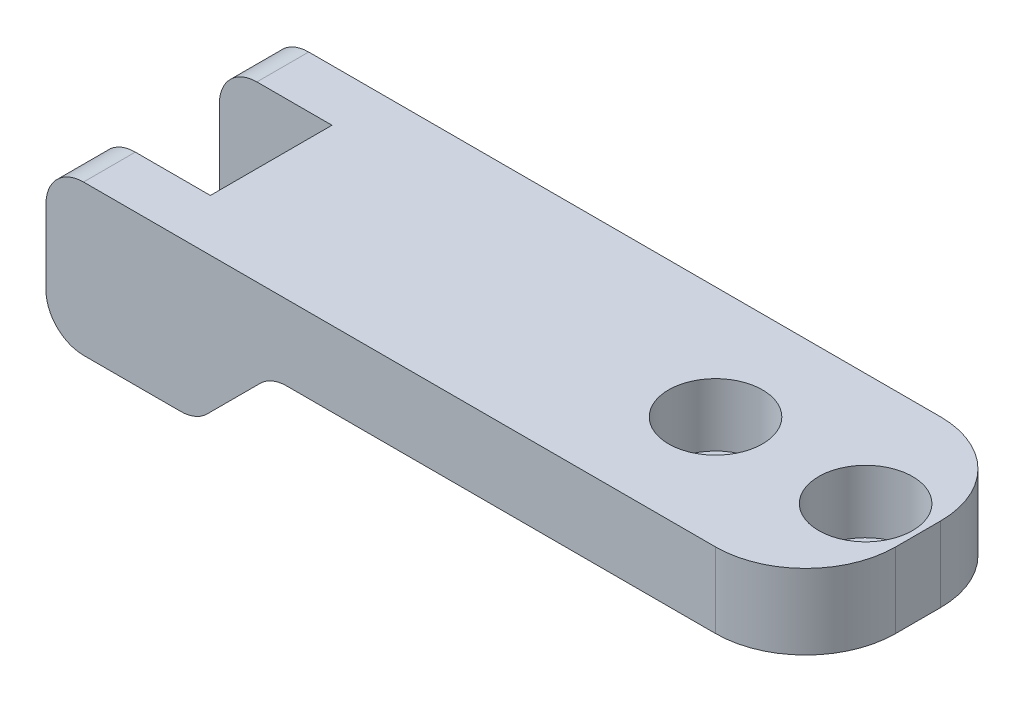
ISO-10303-21;
HEADER;
FILE_DESCRIPTION(('STEP AP214'),'2;1');
FILE_NAME('part.step','',(''),(''),'','','');
FILE_SCHEMA(('AUTOMOTIVE_DESIGN { 1 0 10303 214 1 1 1 1 }'));
ENDSEC;
DATA;
#1=APPLICATION_CONTEXT('core data for automotive mechanical design processes');
#2=APPLICATION_PROTOCOL_DEFINITION('international standard','automotive_design',2000,#1);
#3=PRODUCT_CONTEXT('',#1,'mechanical');
#4=PRODUCT('Part','Part','',(#3));
#5=PRODUCT_RELATED_PRODUCT_CATEGORY('part','',(#4));
#6=PRODUCT_DEFINITION_FORMATION('','',#4);
#7=PRODUCT_DEFINITION_CONTEXT('part definition',#1,'design');
#8=PRODUCT_DEFINITION('design','',#6,#7);
#9=PRODUCT_DEFINITION_SHAPE('','',#8);
#10=(LENGTH_UNIT() NAMED_UNIT(*) SI_UNIT(.MILLI.,.METRE.));
#11=(NAMED_UNIT(*) PLANE_ANGLE_UNIT() SI_UNIT($,.RADIAN.));
#12=(NAMED_UNIT(*) SI_UNIT($,.STERADIAN.) SOLID_ANGLE_UNIT());
#13=UNCERTAINTY_MEASURE_WITH_UNIT(LENGTH_MEASURE(1.E-05),#10,'distance_accuracy_value','');
#14=(GEOMETRIC_REPRESENTATION_CONTEXT(3) GLOBAL_UNCERTAINTY_ASSIGNED_CONTEXT((#13)) GLOBAL_UNIT_ASSIGNED_CONTEXT((#10,
#11,#12)) REPRESENTATION_CONTEXT('',''));
#15=CARTESIAN_POINT('',(0.,0.,0.));
#16=DIRECTION('',(0.,0.,1.));
#17=DIRECTION('',(1.,0.,0.));
#18=AXIS2_PLACEMENT_3D('',#15,#16,#17);
#19=CARTESIAN_POINT('',(-19.05,6.35,9.525));
#20=DIRECTION('',(0.,-1.,0.));
#21=DIRECTION('',(0.,0.,-1.));
#22=AXIS2_PLACEMENT_3D('',#19,#20,#21);
#23=PLANE('',#22);
#24=CARTESIAN_POINT('',(40.767,6.35,0.));
#25=DIRECTION('',(0.,1.,0.));
#26=DIRECTION('',(0.,0.,1.));
#27=AXIS2_PLACEMENT_3D('',#24,#25,#26);
#28=CIRCLE('',#27,3.96875);
#29=CARTESIAN_POINT('',(40.767,6.35,3.96875));
#30=VERTEX_POINT('',#29);
#31=EDGE_CURVE('E715',#30,#30,#28,.T.);
#32=ORIENTED_EDGE('',*,*,#31,.F.);
#33=EDGE_LOOP('',(#32));
#34=FACE_BOUND('',#33,.T.);
#35=DIRECTION('',(-1.,0.,0.));
#36=VECTOR('',#35,1.);
#37=CARTESIAN_POINT('',(-19.05,6.35,-9.525));
#38=LINE('',#37,#36);
#39=CARTESIAN_POINT('',(37.592,6.35,-9.525));
#40=VERTEX_POINT('',#39);
#41=CARTESIAN_POINT('',(-15.875,6.35,-9.525));
#42=VERTEX_POINT('',#41);
#43=EDGE_CURVE('E288',#40,#42,#38,.T.);
#44=ORIENTED_EDGE('',*,*,#43,.T.);
#45=DIRECTION('',(0.,0.,-1.));
#46=VECTOR('',#45,1.);
#47=CARTESIAN_POINT('',(-15.875,6.35,9.525));
#48=LINE('',#47,#46);
#49=CARTESIAN_POINT('',(-15.875,6.35,-5.1435));
#50=VERTEX_POINT('',#49);
#51=EDGE_CURVE('E406',#42,#50,#48,.F.);
#52=ORIENTED_EDGE('',*,*,#51,.T.);
#53=DIRECTION('',(-1.,0.,0.));
#54=VECTOR('',#53,1.);
#55=CARTESIAN_POINT('',(-9.52499999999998,6.35,-5.1435));
#56=LINE('',#55,#54);
#57=CARTESIAN_POINT('',(-9.52499999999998,6.35,-5.1435));
#58=VERTEX_POINT('',#57);
#59=EDGE_CURVE('E241',#58,#50,#56,.T.);
#60=ORIENTED_EDGE('',*,*,#59,.F.);
#61=DIRECTION('',(0.,0.,-1.));
#62=VECTOR('',#61,1.);
#63=CARTESIAN_POINT('',(-9.52499999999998,6.35,5.1435));
#64=LINE('',#63,#62);
#65=CARTESIAN_POINT('',(-9.52499999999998,6.35,5.1435));
#66=VERTEX_POINT('',#65);
#67=EDGE_CURVE('E213',#66,#58,#64,.T.);
#68=ORIENTED_EDGE('',*,*,#67,.F.);
#69=DIRECTION('',(1.,0.,0.));
#70=VECTOR('',#69,1.);
#71=CARTESIAN_POINT('',(-9.52499999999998,6.35,5.1435));
#72=LINE('',#71,#70);
#73=CARTESIAN_POINT('',(-15.875,6.35,5.1435));
#74=VERTEX_POINT('',#73);
#75=EDGE_CURVE('E245',#74,#66,#72,.T.);
#76=ORIENTED_EDGE('',*,*,#75,.F.);
#77=DIRECTION('',(0.,0.,-1.));
#78=VECTOR('',#77,1.);
#79=CARTESIAN_POINT('',(-15.875,6.35,9.525));
#80=LINE('',#79,#78);
#81=CARTESIAN_POINT('',(-15.875,6.35,9.525));
#82=VERTEX_POINT('',#81);
#83=EDGE_CURVE('E403',#74,#82,#80,.F.);
#84=ORIENTED_EDGE('',*,*,#83,.T.);
#85=DIRECTION('',(-1.,0.,0.));
#86=VECTOR('',#85,1.);
#87=CARTESIAN_POINT('',(-19.05,6.35,9.525));
#88=LINE('',#87,#86);
#89=CARTESIAN_POINT('',(37.592,6.35,9.525));
#90=VERTEX_POINT('',#89);
#91=EDGE_CURVE('E269',#90,#82,#88,.T.);
#92=ORIENTED_EDGE('',*,*,#91,.F.);
#93=CARTESIAN_POINT('',(37.592,6.35,1.905));
#94=DIRECTION('',(0.,-1.,0.));
#95=DIRECTION('',(0.,0.,-1.));
#96=AXIS2_PLACEMENT_3D('',#93,#94,#95);
#97=CIRCLE('',#96,7.62);
#98=CARTESIAN_POINT('',(45.212,6.35,1.905));
#99=VERTEX_POINT('',#98);
#100=EDGE_CURVE('E322',#90,#99,#97,.F.);
#101=ORIENTED_EDGE('',*,*,#100,.T.);
#102=DIRECTION('',(0.,0.,-1.));
#103=VECTOR('',#102,1.);
#104=CARTESIAN_POINT('',(45.212,6.35,9.525));
#105=LINE('',#104,#103);
#106=CARTESIAN_POINT('',(45.212,6.35,-1.905));
#107=VERTEX_POINT('',#106);
#108=EDGE_CURVE('E281',#99,#107,#105,.T.);
#109=ORIENTED_EDGE('',*,*,#108,.T.);
#110=CARTESIAN_POINT('',(37.592,6.35,-1.905));
#111=DIRECTION('',(0.,-1.,0.));
#112=DIRECTION('',(0.,0.,-1.));
#113=AXIS2_PLACEMENT_3D('',#110,#111,#112);
#114=CIRCLE('',#113,7.62);
#115=EDGE_CURVE('E325',#107,#40,#114,.F.);
#116=ORIENTED_EDGE('',*,*,#115,.T.);
#117=EDGE_LOOP('',(#44,#52,#60,#68,#76,#84,#92,#101,#109,#116));
#118=FACE_BOUND('',#117,.T.);
#119=CARTESIAN_POINT('',(28.067,6.35,0.));
#120=DIRECTION('',(0.,1.,0.));
#121=DIRECTION('',(0.,0.,1.));
#122=AXIS2_PLACEMENT_3D('',#119,#120,#121);
#123=CIRCLE('',#122,3.96875);
#124=CARTESIAN_POINT('',(28.067,6.35,3.96875));
#125=VERTEX_POINT('',#124);
#126=EDGE_CURVE('E314',#125,#125,#123,.T.);
#127=ORIENTED_EDGE('',*,*,#126,.F.);
#128=EDGE_LOOP('',(#127));
#129=FACE_BOUND('',#128,.T.);
#130=ADVANCED_FACE('F42',(#34,#118,#129),#23,.F.);
#131=CARTESIAN_POINT('',(-19.05,-6.35,9.525));
#132=DIRECTION('',(1.,0.,0.));
#133=DIRECTION('',(0.,0.,-1.));
#134=AXIS2_PLACEMENT_3D('',#131,#132,#133);
#135=PLANE('',#134);
#136=DIRECTION('',(0.,-1.,0.));
#137=VECTOR('',#136,1.);
#138=CARTESIAN_POINT('',(-19.05,-6.35,-9.525));
#139=LINE('',#138,#137);
#140=CARTESIAN_POINT('',(-19.05,3.175,-9.525));
#141=VERTEX_POINT('',#140);
#142=CARTESIAN_POINT('',(-19.05,-3.175,-9.525));
#143=VERTEX_POINT('',#142);
#144=EDGE_CURVE('E292',#141,#143,#139,.T.);
#145=ORIENTED_EDGE('',*,*,#144,.T.);
#146=DIRECTION('',(0.,0.,-1.));
#147=VECTOR('',#146,1.);
#148=CARTESIAN_POINT('',(-19.05,-3.175,9.525));
#149=LINE('',#148,#147);
#150=CARTESIAN_POINT('',(-19.05,-3.175,-5.1435));
#151=VERTEX_POINT('',#150);
#152=EDGE_CURVE('E385',#143,#151,#149,.F.);
#153=ORIENTED_EDGE('',*,*,#152,.T.);
#154=DIRECTION('',(0.,1.,0.));
#155=VECTOR('',#154,1.);
#156=CARTESIAN_POINT('',(-19.05,-6.35,-5.1435));
#157=LINE('',#156,#155);
#158=CARTESIAN_POINT('',(-19.05,3.175,-5.1435));
#159=VERTEX_POINT('',#158);
#160=EDGE_CURVE('E218',#151,#159,#157,.T.);
#161=ORIENTED_EDGE('',*,*,#160,.T.);
#162=DIRECTION('',(0.,0.,-1.));
#163=VECTOR('',#162,1.);
#164=CARTESIAN_POINT('',(-19.05,3.175,9.525));
#165=LINE('',#164,#163);
#166=EDGE_CURVE('E381',#159,#141,#165,.T.);
#167=ORIENTED_EDGE('',*,*,#166,.T.);
#168=EDGE_LOOP('',(#145,#153,#161,#167));
#169=FACE_BOUND('',#168,.T.);
#170=ADVANCED_FACE('F457',(#169),#135,.F.);
#171=CARTESIAN_POINT('',(-6.34999999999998,-6.35,9.525));
#172=DIRECTION('',(-0.707106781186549,0.707106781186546,0.));
#173=DIRECTION('',(-0.707106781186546,-0.707106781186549,0.));
#174=AXIS2_PLACEMENT_3D('',#171,#172,#173);
#175=PLANE('',#174);
#176=DIRECTION('',(0.707106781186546,0.707106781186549,0.));
#177=VECTOR('',#176,1.);
#178=CARTESIAN_POINT('',(-6.34999999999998,-6.35,9.525));
#179=LINE('',#178,#177);
#180=CARTESIAN_POINT('',(-5.42006403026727,-5.42006403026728,9.525));
#181=VERTEX_POINT('',#180);
#182=CARTESIAN_POINT('',(-0.929935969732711,-0.929935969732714,9.525));
#183=VERTEX_POINT('',#182);
#184=EDGE_CURVE('E261',#181,#183,#179,.T.);
#185=ORIENTED_EDGE('',*,*,#184,.F.);
#186=DIRECTION('',(0.,0.,-1.));
#187=VECTOR('',#186,1.);
#188=CARTESIAN_POINT('',(-5.42006403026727,-5.42006403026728,9.525));
#189=LINE('',#188,#187);
#190=CARTESIAN_POINT('',(-5.42006403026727,-5.42006403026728,-9.525));
#191=VERTEX_POINT('',#190);
#192=EDGE_CURVE('E346',#181,#191,#189,.T.);
#193=ORIENTED_EDGE('',*,*,#192,.T.);
#194=DIRECTION('',(0.707106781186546,0.707106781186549,0.));
#195=VECTOR('',#194,1.);
#196=CARTESIAN_POINT('',(-6.34999999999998,-6.35,-9.525));
#197=LINE('',#196,#195);
#198=CARTESIAN_POINT('',(-0.929935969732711,-0.929935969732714,-9.525));
#199=VERTEX_POINT('',#198);
#200=EDGE_CURVE('E255',#191,#199,#197,.T.);
#201=ORIENTED_EDGE('',*,*,#200,.T.);
#202=DIRECTION('',(0.,0.,-1.));
#203=VECTOR('',#202,1.);
#204=CARTESIAN_POINT('',(-0.929935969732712,-0.929935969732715,9.525));
#205=LINE('',#204,#203);
#206=EDGE_CURVE('E343',#199,#183,#205,.F.);
#207=ORIENTED_EDGE('',*,*,#206,.T.);
#208=EDGE_LOOP('',(#185,#193,#201,#207));
#209=FACE_BOUND('',#208,.T.);
#210=ADVANCED_FACE('F418',(#209),#175,.F.);
#211=CARTESIAN_POINT('',(0.,0.,9.525));
#212=DIRECTION('',(0.,1.,0.));
#213=DIRECTION('',(0.,0.,1.));
#214=AXIS2_PLACEMENT_3D('',#211,#212,#213);
#215=PLANE('',#214);
#216=CARTESIAN_POINT('',(40.767,0.,0.));
#217=DIRECTION('',(0.,1.,0.));
#218=DIRECTION('',(0.,0.,1.));
#219=AXIS2_PLACEMENT_3D('',#216,#217,#218);
#220=CIRCLE('',#219,2.45745);
#221=CARTESIAN_POINT('',(40.767,0.,2.45745));
#222=VERTEX_POINT('',#221);
#223=EDGE_CURVE('E310',#222,#222,#220,.T.);
#224=ORIENTED_EDGE('',*,*,#223,.T.);
#225=EDGE_LOOP('',(#224));
#226=FACE_BOUND('',#225,.T.);
#227=CARTESIAN_POINT('',(28.067,0.,0.));
#228=DIRECTION('',(0.,1.,0.));
#229=DIRECTION('',(0.,0.,1.));
#230=AXIS2_PLACEMENT_3D('',#227,#228,#229);
#231=CIRCLE('',#230,2.45745);
#232=CARTESIAN_POINT('',(28.067,0.,2.45745));
#233=VERTEX_POINT('',#232);
#234=EDGE_CURVE('E248',#233,#233,#231,.T.);
#235=ORIENTED_EDGE('',*,*,#234,.T.);
#236=EDGE_LOOP('',(#235));
#237=FACE_BOUND('',#236,.T.);
#238=DIRECTION('',(1.,0.,0.));
#239=VECTOR('',#238,1.);
#240=CARTESIAN_POINT('',(0.,0.,9.525));
#241=LINE('',#240,#239);
#242=CARTESIAN_POINT('',(1.31512806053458,0.,9.525));
#243=VERTEX_POINT('',#242);
#244=CARTESIAN_POINT('',(37.592,0.,9.525));
#245=VERTEX_POINT('',#244);
#246=EDGE_CURVE('E265',#243,#245,#241,.T.);
#247=ORIENTED_EDGE('',*,*,#246,.F.);
#248=DIRECTION('',(0.,0.,-1.));
#249=VECTOR('',#248,1.);
#250=CARTESIAN_POINT('',(1.31512806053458,0.,-9.525));
#251=LINE('',#250,#249);
#252=CARTESIAN_POINT('',(1.31512806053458,0.,-9.525));
#253=VERTEX_POINT('',#252);
#254=EDGE_CURVE('E377',#243,#253,#251,.T.);
#255=ORIENTED_EDGE('',*,*,#254,.T.);
#256=DIRECTION('',(1.,0.,0.));
#257=VECTOR('',#256,1.);
#258=CARTESIAN_POINT('',(0.,0.,-9.525));
#259=LINE('',#258,#257);
#260=CARTESIAN_POINT('',(37.592,0.,-9.525));
#261=VERTEX_POINT('',#260);
#262=EDGE_CURVE('E285',#253,#261,#259,.T.);
#263=ORIENTED_EDGE('',*,*,#262,.T.);
#264=CARTESIAN_POINT('',(37.592,0.,-1.905));
#265=DIRECTION('',(0.,1.,0.));
#266=DIRECTION('',(0.,0.,1.));
#267=AXIS2_PLACEMENT_3D('',#264,#265,#266);
#268=CIRCLE('',#267,7.62);
#269=CARTESIAN_POINT('',(45.212,0.,-1.905));
#270=VERTEX_POINT('',#269);
#271=EDGE_CURVE('E336',#261,#270,#268,.F.);
#272=ORIENTED_EDGE('',*,*,#271,.T.);
#273=DIRECTION('',(0.,0.,-1.));
#274=VECTOR('',#273,1.);
#275=CARTESIAN_POINT('',(45.212,0.,9.525));
#276=LINE('',#275,#274);
#277=CARTESIAN_POINT('',(45.212,0.,1.905));
#278=VERTEX_POINT('',#277);
#279=EDGE_CURVE('E301',#278,#270,#276,.T.);
#280=ORIENTED_EDGE('',*,*,#279,.F.);
#281=CARTESIAN_POINT('',(37.592,0.,1.905));
#282=DIRECTION('',(0.,1.,0.));
#283=DIRECTION('',(0.,0.,1.));
#284=AXIS2_PLACEMENT_3D('',#281,#282,#283);
#285=CIRCLE('',#284,7.62);
#286=EDGE_CURVE('E332',#278,#245,#285,.F.);
#287=ORIENTED_EDGE('',*,*,#286,.T.);
#288=EDGE_LOOP('',(#247,#255,#263,#272,#280,#287));
#289=FACE_BOUND('',#288,.T.);
#290=ADVANCED_FACE('F426',(#226,#237,#289),#215,.F.);
#291=CARTESIAN_POINT('',(45.212,6.35,9.525));
#292=DIRECTION('',(-1.,0.,0.));
#293=DIRECTION('',(0.,0.,1.));
#294=AXIS2_PLACEMENT_3D('',#291,#292,#293);
#295=PLANE('',#294);
#296=ORIENTED_EDGE('',*,*,#279,.T.);
#297=DIRECTION('',(0.,1.,0.));
#298=VECTOR('',#297,1.);
#299=CARTESIAN_POINT('',(45.212,6.35,-1.905));
#300=LINE('',#299,#298);
#301=EDGE_CURVE('E318',#270,#107,#300,.T.);
#302=ORIENTED_EDGE('',*,*,#301,.T.);
#303=ORIENTED_EDGE('',*,*,#108,.F.);
#304=DIRECTION('',(0.,1.,0.));
#305=VECTOR('',#304,1.);
#306=CARTESIAN_POINT('',(45.212,6.35,1.905));
#307=LINE('',#306,#305);
#308=EDGE_CURVE('E305',#99,#278,#307,.F.);
#309=ORIENTED_EDGE('',*,*,#308,.T.);
#310=EDGE_LOOP('',(#296,#302,#303,#309));
#311=FACE_BOUND('',#310,.T.);
#312=ADVANCED_FACE('F479',(#311),#295,.F.);
#313=DIRECTION('',(0.,1.,0.));
#314=VECTOR('',#313,1.);
#315=CARTESIAN_POINT('',(-19.05,-6.35,5.1435));
#316=LINE('',#315,#314);
#317=CARTESIAN_POINT('',(-19.05,-3.175,5.1435));
#318=VERTEX_POINT('',#317);
#319=CARTESIAN_POINT('',(-19.05,3.175,5.1435));
#320=VERTEX_POINT('',#319);
#321=EDGE_CURVE('E231',#318,#320,#316,.T.);
#322=ORIENTED_EDGE('',*,*,#321,.F.);
#323=DIRECTION('',(0.,0.,-1.));
#324=VECTOR('',#323,1.);
#325=CARTESIAN_POINT('',(-19.05,-3.175,9.525));
#326=LINE('',#325,#324);
#327=CARTESIAN_POINT('',(-19.05,-3.175,9.525));
#328=VERTEX_POINT('',#327);
#329=EDGE_CURVE('E400',#318,#328,#326,.F.);
#330=ORIENTED_EDGE('',*,*,#329,.T.);
#331=DIRECTION('',(0.,-1.,0.));
#332=VECTOR('',#331,1.);
#333=CARTESIAN_POINT('',(-19.05,-6.35,9.525));
#334=LINE('',#333,#332);
#335=CARTESIAN_POINT('',(-19.05,3.175,9.525));
#336=VERTEX_POINT('',#335);
#337=EDGE_CURVE('E273',#336,#328,#334,.T.);
#338=ORIENTED_EDGE('',*,*,#337,.F.);
#339=DIRECTION('',(0.,0.,-1.));
#340=VECTOR('',#339,1.);
#341=CARTESIAN_POINT('',(-19.05,3.175,9.525));
#342=LINE('',#341,#340);
#343=EDGE_CURVE('E397',#336,#320,#342,.T.);
#344=ORIENTED_EDGE('',*,*,#343,.T.);
#345=EDGE_LOOP('',(#322,#330,#338,#344));
#346=FACE_BOUND('',#345,.T.);
#347=ADVANCED_FACE('F442',(#346),#135,.F.);
#348=CARTESIAN_POINT('',(-6.34999999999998,-6.35,9.525));
#349=DIRECTION('',(0.,1.,0.));
#350=DIRECTION('',(-1.,0.,0.));
#351=AXIS2_PLACEMENT_3D('',#348,#349,#350);
#352=PLANE('',#351);
#353=DIRECTION('',(1.,0.,0.));
#354=VECTOR('',#353,1.);
#355=CARTESIAN_POINT('',(-6.34999999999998,-6.35,-9.525));
#356=LINE('',#355,#354);
#357=CARTESIAN_POINT('',(-15.875,-6.35,-9.525));
#358=VERTEX_POINT('',#357);
#359=CARTESIAN_POINT('',(-7.66512806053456,-6.35,-9.525));
#360=VERTEX_POINT('',#359);
#361=EDGE_CURVE('E266',#358,#360,#356,.T.);
#362=ORIENTED_EDGE('',*,*,#361,.T.);
#363=DIRECTION('',(0.,0.,-1.));
#364=VECTOR('',#363,1.);
#365=CARTESIAN_POINT('',(-7.66512806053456,-6.35,9.525));
#366=LINE('',#365,#364);
#367=CARTESIAN_POINT('',(-7.66512806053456,-6.35,9.525));
#368=VERTEX_POINT('',#367);
#369=EDGE_CURVE('E365',#360,#368,#366,.F.);
#370=ORIENTED_EDGE('',*,*,#369,.T.);
#371=DIRECTION('',(1.,0.,0.));
#372=VECTOR('',#371,1.);
#373=CARTESIAN_POINT('',(-6.34999999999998,-6.35,9.525));
#374=LINE('',#373,#372);
#375=CARTESIAN_POINT('',(-15.875,-6.35,9.525));
#376=VERTEX_POINT('',#375);
#377=EDGE_CURVE('E277',#376,#368,#374,.T.);
#378=ORIENTED_EDGE('',*,*,#377,.F.);
#379=DIRECTION('',(0.,0.,-1.));
#380=VECTOR('',#379,1.);
#381=CARTESIAN_POINT('',(-15.875,-6.35,9.525));
#382=LINE('',#381,#380);
#383=CARTESIAN_POINT('',(-15.875,-6.35,5.1435));
#384=VERTEX_POINT('',#383);
#385=EDGE_CURVE('E359',#376,#384,#382,.T.);
#386=ORIENTED_EDGE('',*,*,#385,.T.);
#387=DIRECTION('',(1.,0.,0.));
#388=VECTOR('',#387,1.);
#389=CARTESIAN_POINT('',(-9.52499999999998,-6.35,5.1435));
#390=LINE('',#389,#388);
#391=CARTESIAN_POINT('',(-9.52499999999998,-6.35,5.1435));
#392=VERTEX_POINT('',#391);
#393=EDGE_CURVE('E236',#384,#392,#390,.T.);
#394=ORIENTED_EDGE('',*,*,#393,.T.);
#395=DIRECTION('',(0.,0.,-1.));
#396=VECTOR('',#395,1.);
#397=CARTESIAN_POINT('',(-9.52499999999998,-6.35,5.1435));
#398=LINE('',#397,#396);
#399=CARTESIAN_POINT('',(-9.52499999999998,-6.35,-5.1435));
#400=VERTEX_POINT('',#399);
#401=EDGE_CURVE('E210',#392,#400,#398,.T.);
#402=ORIENTED_EDGE('',*,*,#401,.T.);
#403=DIRECTION('',(-1.,0.,0.));
#404=VECTOR('',#403,1.);
#405=CARTESIAN_POINT('',(-9.52499999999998,-6.35,-5.1435));
#406=LINE('',#405,#404);
#407=CARTESIAN_POINT('',(-15.875,-6.35,-5.1435));
#408=VERTEX_POINT('',#407);
#409=EDGE_CURVE('E222',#400,#408,#406,.T.);
#410=ORIENTED_EDGE('',*,*,#409,.T.);
#411=DIRECTION('',(0.,0.,-1.));
#412=VECTOR('',#411,1.);
#413=CARTESIAN_POINT('',(-15.875,-6.35,9.525));
#414=LINE('',#413,#412);
#415=EDGE_CURVE('E362',#408,#358,#414,.T.);
#416=ORIENTED_EDGE('',*,*,#415,.T.);
#417=EDGE_LOOP('',(#362,#370,#378,#386,#394,#402,#410,#416));
#418=FACE_BOUND('',#417,.T.);
#419=ADVANCED_FACE('F234',(#418),#352,.F.);
#420=CARTESIAN_POINT('',(0.,0.,9.525));
#421=DIRECTION('',(0.,0.,-1.));
#422=DIRECTION('',(-1.,0.,0.));
#423=AXIS2_PLACEMENT_3D('',#420,#421,#422);
#424=PLANE('',#423);
#425=ORIENTED_EDGE('',*,*,#377,.T.);
#426=CARTESIAN_POINT('',(-7.66512806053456,-3.175,9.525));
#427=DIRECTION('',(0.,0.,-1.));
#428=DIRECTION('',(-1.,0.,0.));
#429=AXIS2_PLACEMENT_3D('',#426,#427,#428);
#430=CIRCLE('',#429,3.175);
#431=EDGE_CURVE('E374',#368,#181,#430,.F.);
#432=ORIENTED_EDGE('',*,*,#431,.T.);
#433=ORIENTED_EDGE('',*,*,#184,.T.);
#434=CARTESIAN_POINT('',(1.31512806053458,-3.175,9.525));
#435=DIRECTION('',(0.,0.,-1.));
#436=DIRECTION('',(-1.,0.,0.));
#437=AXIS2_PLACEMENT_3D('',#434,#435,#436);
#438=CIRCLE('',#437,3.175);
#439=EDGE_CURVE('E11',#183,#243,#438,.T.);
#440=ORIENTED_EDGE('',*,*,#439,.T.);
#441=ORIENTED_EDGE('',*,*,#246,.T.);
#442=DIRECTION('',(0.,1.,0.));
#443=VECTOR('',#442,1.);
#444=CARTESIAN_POINT('',(37.592,0.,9.525));
#445=LINE('',#444,#443);
#446=EDGE_CURVE('E339',#245,#90,#445,.T.);
#447=ORIENTED_EDGE('',*,*,#446,.T.);
#448=ORIENTED_EDGE('',*,*,#91,.T.);
#449=CARTESIAN_POINT('',(-15.875,3.175,9.525));
#450=DIRECTION('',(0.,0.,-1.));
#451=DIRECTION('',(-1.,0.,0.));
#452=AXIS2_PLACEMENT_3D('',#449,#450,#451);
#453=CIRCLE('',#452,3.175);
#454=EDGE_CURVE('E368',#82,#336,#453,.F.);
#455=ORIENTED_EDGE('',*,*,#454,.T.);
#456=ORIENTED_EDGE('',*,*,#337,.T.);
#457=CARTESIAN_POINT('',(-15.875,-3.175,9.525));
#458=DIRECTION('',(0.,0.,-1.));
#459=DIRECTION('',(-1.,0.,0.));
#460=AXIS2_PLACEMENT_3D('',#457,#458,#459);
#461=CIRCLE('',#460,3.175);
#462=EDGE_CURVE('E371',#328,#376,#461,.F.);
#463=ORIENTED_EDGE('',*,*,#462,.T.);
#464=EDGE_LOOP('',(#425,#432,#433,#440,#441,#447,#448,#455,#456,#463));
#465=FACE_BOUND('',#464,.T.);
#466=ADVANCED_FACE('F424',(#465),#424,.F.);
#467=CARTESIAN_POINT('',(0.,0.,-9.525));
#468=DIRECTION('',(0.,0.,-1.));
#469=DIRECTION('',(-1.,0.,0.));
#470=AXIS2_PLACEMENT_3D('',#467,#468,#469);
#471=PLANE('',#470);
#472=ORIENTED_EDGE('',*,*,#200,.F.);
#473=CARTESIAN_POINT('',(-7.66512806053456,-3.175,-9.525));
#474=DIRECTION('',(0.,0.,-1.));
#475=DIRECTION('',(-1.,0.,0.));
#476=AXIS2_PLACEMENT_3D('',#473,#474,#475);
#477=CIRCLE('',#476,3.175);
#478=EDGE_CURVE('E356',#191,#360,#477,.T.);
#479=ORIENTED_EDGE('',*,*,#478,.T.);
#480=ORIENTED_EDGE('',*,*,#361,.F.);
#481=CARTESIAN_POINT('',(-15.875,-3.175,-9.525));
#482=DIRECTION('',(0.,0.,-1.));
#483=DIRECTION('',(-1.,0.,0.));
#484=AXIS2_PLACEMENT_3D('',#481,#482,#483);
#485=CIRCLE('',#484,3.175);
#486=EDGE_CURVE('E353',#358,#143,#485,.T.);
#487=ORIENTED_EDGE('',*,*,#486,.T.);
#488=ORIENTED_EDGE('',*,*,#144,.F.);
#489=CARTESIAN_POINT('',(-15.875,3.175,-9.525));
#490=DIRECTION('',(0.,0.,-1.));
#491=DIRECTION('',(-1.,0.,0.));
#492=AXIS2_PLACEMENT_3D('',#489,#490,#491);
#493=CIRCLE('',#492,3.175);
#494=EDGE_CURVE('E350',#141,#42,#493,.T.);
#495=ORIENTED_EDGE('',*,*,#494,.T.);
#496=ORIENTED_EDGE('',*,*,#43,.F.);
#497=DIRECTION('',(0.,1.,0.));
#498=VECTOR('',#497,1.);
#499=CARTESIAN_POINT('',(37.592,0.,-9.525));
#500=LINE('',#499,#498);
#501=EDGE_CURVE('E328',#40,#261,#500,.F.);
#502=ORIENTED_EDGE('',*,*,#501,.T.);
#503=ORIENTED_EDGE('',*,*,#262,.F.);
#504=CARTESIAN_POINT('',(1.31512806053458,-3.175,-9.525));
#505=DIRECTION('',(0.,0.,-1.));
#506=DIRECTION('',(-1.,0.,0.));
#507=AXIS2_PLACEMENT_3D('',#504,#505,#506);
#508=CIRCLE('',#507,3.175);
#509=EDGE_CURVE('E51',#253,#199,#508,.F.);
#510=ORIENTED_EDGE('',*,*,#509,.T.);
#511=EDGE_LOOP('',(#472,#479,#480,#487,#488,#495,#496,#502,#503,#510));
#512=FACE_BOUND('',#511,.T.);
#513=ADVANCED_FACE('F412',(#512),#471,.T.);
#514=CARTESIAN_POINT('',(-9.52499999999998,-6.35,-5.1435));
#515=DIRECTION('',(0.,0.,-1.));
#516=DIRECTION('',(-1.,0.,0.));
#517=AXIS2_PLACEMENT_3D('',#514,#515,#516);
#518=PLANE('',#517);
#519=ORIENTED_EDGE('',*,*,#160,.F.);
#520=CARTESIAN_POINT('',(-15.875,-3.175,-5.1435));
#521=DIRECTION('',(0.,0.,-1.));
#522=DIRECTION('',(-1.,0.,0.));
#523=AXIS2_PLACEMENT_3D('',#520,#521,#522);
#524=CIRCLE('',#523,3.175);
#525=EDGE_CURVE('E226',#151,#408,#524,.F.);
#526=ORIENTED_EDGE('',*,*,#525,.T.);
#527=ORIENTED_EDGE('',*,*,#409,.F.);
#528=DIRECTION('',(0.,1.,0.));
#529=VECTOR('',#528,1.);
#530=CARTESIAN_POINT('',(-9.52499999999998,-6.35,-5.1435));
#531=LINE('',#530,#529);
#532=EDGE_CURVE('E205',#400,#58,#531,.T.);
#533=ORIENTED_EDGE('',*,*,#532,.T.);
#534=ORIENTED_EDGE('',*,*,#59,.T.);
#535=CARTESIAN_POINT('',(-15.875,3.175,-5.1435));
#536=DIRECTION('',(0.,0.,-1.));
#537=DIRECTION('',(-1.,0.,0.));
#538=AXIS2_PLACEMENT_3D('',#535,#536,#537);
#539=CIRCLE('',#538,3.175);
#540=EDGE_CURVE('E388',#50,#159,#539,.F.);
#541=ORIENTED_EDGE('',*,*,#540,.T.);
#542=EDGE_LOOP('',(#519,#526,#527,#533,#534,#541));
#543=FACE_BOUND('',#542,.T.);
#544=ADVANCED_FACE('F224',(#543),#518,.F.);
#545=CARTESIAN_POINT('',(-9.52499999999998,-6.35,5.1435));
#546=DIRECTION('',(1.,0.,0.));
#547=DIRECTION('',(0.,0.,-1.));
#548=AXIS2_PLACEMENT_3D('',#545,#546,#547);
#549=PLANE('',#548);
#550=ORIENTED_EDGE('',*,*,#67,.T.);
#551=ORIENTED_EDGE('',*,*,#532,.F.);
#552=ORIENTED_EDGE('',*,*,#401,.F.);
#553=DIRECTION('',(0.,1.,0.));
#554=VECTOR('',#553,1.);
#555=CARTESIAN_POINT('',(-9.52499999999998,-6.35,5.1435));
#556=LINE('',#555,#554);
#557=EDGE_CURVE('E219',#392,#66,#556,.T.);
#558=ORIENTED_EDGE('',*,*,#557,.T.);
#559=EDGE_LOOP('',(#550,#551,#552,#558));
#560=FACE_BOUND('',#559,.T.);
#561=ADVANCED_FACE('F207',(#560),#549,.F.);
#562=CARTESIAN_POINT('',(-9.52499999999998,-6.35,5.1435));
#563=DIRECTION('',(0.,0.,1.));
#564=DIRECTION('',(1.,0.,0.));
#565=AXIS2_PLACEMENT_3D('',#562,#563,#564);
#566=PLANE('',#565);
#567=ORIENTED_EDGE('',*,*,#393,.F.);
#568=CARTESIAN_POINT('',(-15.875,-3.175,5.1435));
#569=DIRECTION('',(0.,0.,1.));
#570=DIRECTION('',(1.,0.,0.));
#571=AXIS2_PLACEMENT_3D('',#568,#569,#570);
#572=CIRCLE('',#571,3.175);
#573=EDGE_CURVE('E71',#384,#318,#572,.F.);
#574=ORIENTED_EDGE('',*,*,#573,.T.);
#575=ORIENTED_EDGE('',*,*,#321,.T.);
#576=CARTESIAN_POINT('',(-15.875,3.175,5.1435));
#577=DIRECTION('',(0.,0.,1.));
#578=DIRECTION('',(1.,0.,0.));
#579=AXIS2_PLACEMENT_3D('',#576,#577,#578);
#580=CIRCLE('',#579,3.175);
#581=EDGE_CURVE('E61',#320,#74,#580,.F.);
#582=ORIENTED_EDGE('',*,*,#581,.T.);
#583=ORIENTED_EDGE('',*,*,#75,.T.);
#584=ORIENTED_EDGE('',*,*,#557,.F.);
#585=EDGE_LOOP('',(#567,#574,#575,#582,#583,#584));
#586=FACE_BOUND('',#585,.T.);
#587=ADVANCED_FACE('F604',(#586),#566,.F.);
#588=CARTESIAN_POINT('',(28.067,6.35,0.));
#589=DIRECTION('',(0.,1.,0.));
#590=DIRECTION('',(0.,0.,1.));
#591=AXIS2_PLACEMENT_3D('',#588,#589,#590);
#592=CYLINDRICAL_SURFACE('',#591,2.45745);
#593=CARTESIAN_POINT('',(28.067,1.0414,0.));
#594=DIRECTION('',(0.,1.,0.));
#595=DIRECTION('',(0.,0.,1.));
#596=AXIS2_PLACEMENT_3D('',#593,#594,#595);
#597=CIRCLE('',#596,2.45745);
#598=CARTESIAN_POINT('',(28.067,1.0414,2.45745));
#599=VERTEX_POINT('',#598);
#600=EDGE_CURVE('E309',#599,#599,#597,.T.);
#601=ORIENTED_EDGE('',*,*,#600,.T.);
#602=EDGE_LOOP('',(#601));
#603=FACE_BOUND('',#602,.T.);
#604=ORIENTED_EDGE('',*,*,#234,.F.);
#605=EDGE_LOOP('',(#604));
#606=FACE_BOUND('',#605,.T.);
#607=ADVANCED_FACE('F595',(#603,#606),#592,.F.);
#608=CARTESIAN_POINT('',(30.52445,1.0414,0.));
#609=DIRECTION('',(0.,-1.,0.));
#610=DIRECTION('',(0.,0.,-1.));
#611=AXIS2_PLACEMENT_3D('',#608,#609,#610);
#612=PLANE('',#611);
#613=ORIENTED_EDGE('',*,*,#600,.F.);
#614=EDGE_LOOP('',(#613));
#615=FACE_BOUND('',#614,.T.);
#616=CARTESIAN_POINT('',(28.067,1.0414,0.));
#617=DIRECTION('',(0.,1.,0.));
#618=DIRECTION('',(0.,0.,1.));
#619=AXIS2_PLACEMENT_3D('',#616,#617,#618);
#620=CIRCLE('',#619,3.96875);
#621=CARTESIAN_POINT('',(28.067,1.0414,3.96875));
#622=VERTEX_POINT('',#621);
#623=EDGE_CURVE('E701',#622,#622,#620,.T.);
#624=ORIENTED_EDGE('',*,*,#623,.T.);
#625=EDGE_LOOP('',(#624));
#626=FACE_BOUND('',#625,.T.);
#627=ADVANCED_FACE('F586',(#615,#626),#612,.F.);
#628=CARTESIAN_POINT('',(28.067,6.35,0.));
#629=DIRECTION('',(0.,1.,0.));
#630=DIRECTION('',(0.,0.,1.));
#631=AXIS2_PLACEMENT_3D('',#628,#629,#630);
#632=CYLINDRICAL_SURFACE('',#631,3.96875);
#633=ORIENTED_EDGE('',*,*,#623,.F.);
#634=EDGE_LOOP('',(#633));
#635=FACE_BOUND('',#634,.T.);
#636=ORIENTED_EDGE('',*,*,#126,.T.);
#637=EDGE_LOOP('',(#636));
#638=FACE_BOUND('',#637,.T.);
#639=ADVANCED_FACE('F577',(#635,#638),#632,.F.);
#640=CARTESIAN_POINT('',(40.767,6.35,0.));
#641=DIRECTION('',(0.,1.,0.));
#642=DIRECTION('',(0.,0.,1.));
#643=AXIS2_PLACEMENT_3D('',#640,#641,#642);
#644=CYLINDRICAL_SURFACE('',#643,2.45745);
#645=CARTESIAN_POINT('',(40.767,1.0414,0.));
#646=DIRECTION('',(0.,1.,0.));
#647=DIRECTION('',(0.,0.,1.));
#648=AXIS2_PLACEMENT_3D('',#645,#646,#647);
#649=CIRCLE('',#648,2.45745);
#650=CARTESIAN_POINT('',(40.767,1.0414,2.45745));
#651=VERTEX_POINT('',#650);
#652=EDGE_CURVE('E315',#651,#651,#649,.T.);
#653=ORIENTED_EDGE('',*,*,#652,.T.);
#654=EDGE_LOOP('',(#653));
#655=FACE_BOUND('',#654,.T.);
#656=ORIENTED_EDGE('',*,*,#223,.F.);
#657=EDGE_LOOP('',(#656));
#658=FACE_BOUND('',#657,.T.);
#659=ADVANCED_FACE('F568',(#655,#658),#644,.F.);
#660=CARTESIAN_POINT('',(43.22445,1.0414,0.));
#661=DIRECTION('',(0.,-1.,0.));
#662=DIRECTION('',(0.,0.,-1.));
#663=AXIS2_PLACEMENT_3D('',#660,#661,#662);
#664=PLANE('',#663);
#665=ORIENTED_EDGE('',*,*,#652,.F.);
#666=EDGE_LOOP('',(#665));
#667=FACE_BOUND('',#666,.T.);
#668=CARTESIAN_POINT('',(40.767,1.0414,0.));
#669=DIRECTION('',(0.,1.,0.));
#670=DIRECTION('',(0.,0.,1.));
#671=AXIS2_PLACEMENT_3D('',#668,#669,#670);
#672=CIRCLE('',#671,3.96875);
#673=CARTESIAN_POINT('',(40.767,1.0414,3.96875));
#674=VERTEX_POINT('',#673);
#675=EDGE_CURVE('E711',#674,#674,#672,.T.);
#676=ORIENTED_EDGE('',*,*,#675,.T.);
#677=EDGE_LOOP('',(#676));
#678=FACE_BOUND('',#677,.T.);
#679=ADVANCED_FACE('F559',(#667,#678),#664,.F.);
#680=CARTESIAN_POINT('',(40.767,6.35,0.));
#681=DIRECTION('',(0.,1.,0.));
#682=DIRECTION('',(0.,0.,1.));
#683=AXIS2_PLACEMENT_3D('',#680,#681,#682);
#684=CYLINDRICAL_SURFACE('',#683,3.96875);
#685=ORIENTED_EDGE('',*,*,#675,.F.);
#686=EDGE_LOOP('',(#685));
#687=FACE_BOUND('',#686,.T.);
#688=ORIENTED_EDGE('',*,*,#31,.T.);
#689=EDGE_LOOP('',(#688));
#690=FACE_BOUND('',#689,.T.);
#691=ADVANCED_FACE('F491',(#687,#690),#684,.F.);
#692=CARTESIAN_POINT('',(37.592,6.35,-1.905));
#693=DIRECTION('',(0.,-1.,0.));
#694=DIRECTION('',(0.,0.,-1.));
#695=AXIS2_PLACEMENT_3D('',#692,#693,#694);
#696=CYLINDRICAL_SURFACE('',#695,7.62);
#697=ORIENTED_EDGE('',*,*,#271,.F.);
#698=ORIENTED_EDGE('',*,*,#501,.F.);
#699=ORIENTED_EDGE('',*,*,#115,.F.);
#700=ORIENTED_EDGE('',*,*,#301,.F.);
#701=EDGE_LOOP('',(#697,#698,#699,#700));
#702=FACE_BOUND('',#701,.T.);
#703=ADVANCED_FACE('F488',(#702),#696,.T.);
#704=CARTESIAN_POINT('',(37.592,0.,1.905));
#705=DIRECTION('',(0.,1.,0.));
#706=DIRECTION('',(0.,0.,1.));
#707=AXIS2_PLACEMENT_3D('',#704,#705,#706);
#708=CYLINDRICAL_SURFACE('',#707,7.62);
#709=ORIENTED_EDGE('',*,*,#286,.F.);
#710=ORIENTED_EDGE('',*,*,#308,.F.);
#711=ORIENTED_EDGE('',*,*,#100,.F.);
#712=ORIENTED_EDGE('',*,*,#446,.F.);
#713=EDGE_LOOP('',(#709,#710,#711,#712));
#714=FACE_BOUND('',#713,.T.);
#715=ADVANCED_FACE('F432',(#714),#708,.T.);
#716=CARTESIAN_POINT('',(-7.66512806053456,-3.175,9.525));
#717=DIRECTION('',(0.,0.,-1.));
#718=DIRECTION('',(-1.,0.,0.));
#719=AXIS2_PLACEMENT_3D('',#716,#717,#718);
#720=CYLINDRICAL_SURFACE('',#719,3.175);
#721=ORIENTED_EDGE('',*,*,#431,.F.);
#722=ORIENTED_EDGE('',*,*,#369,.F.);
#723=ORIENTED_EDGE('',*,*,#478,.F.);
#724=ORIENTED_EDGE('',*,*,#192,.F.);
#725=EDGE_LOOP('',(#721,#722,#723,#724));
#726=FACE_BOUND('',#725,.T.);
#727=ADVANCED_FACE('F452',(#726),#720,.T.);
#728=CARTESIAN_POINT('',(1.31512806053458,-3.175,9.525));
#729=DIRECTION('',(0.,0.,1.));
#730=DIRECTION('',(1.,0.,0.));
#731=AXIS2_PLACEMENT_3D('',#728,#729,#730);
#732=CYLINDRICAL_SURFACE('',#731,3.175);
#733=ORIENTED_EDGE('',*,*,#439,.F.);
#734=ORIENTED_EDGE('',*,*,#206,.F.);
#735=ORIENTED_EDGE('',*,*,#509,.F.);
#736=ORIENTED_EDGE('',*,*,#254,.F.);
#737=EDGE_LOOP('',(#733,#734,#735,#736));
#738=FACE_BOUND('',#737,.T.);
#739=ADVANCED_FACE('F421',(#738),#732,.F.);
#740=CARTESIAN_POINT('',(-15.875,-3.175,9.525));
#741=DIRECTION('',(0.,0.,-1.));
#742=DIRECTION('',(-1.,0.,0.));
#743=AXIS2_PLACEMENT_3D('',#740,#741,#742);
#744=CYLINDRICAL_SURFACE('',#743,3.175);
#745=ORIENTED_EDGE('',*,*,#525,.F.);
#746=ORIENTED_EDGE('',*,*,#152,.F.);
#747=ORIENTED_EDGE('',*,*,#486,.F.);
#748=ORIENTED_EDGE('',*,*,#415,.F.);
#749=EDGE_LOOP('',(#745,#746,#747,#748));
#750=FACE_BOUND('',#749,.T.);
#751=ADVANCED_FACE('F459',(#750),#744,.T.);
#752=CARTESIAN_POINT('',(-15.875,-3.175,9.525));
#753=DIRECTION('',(0.,0.,-1.));
#754=DIRECTION('',(-1.,0.,0.));
#755=AXIS2_PLACEMENT_3D('',#752,#753,#754);
#756=CYLINDRICAL_SURFACE('',#755,3.175);
#757=ORIENTED_EDGE('',*,*,#462,.F.);
#758=ORIENTED_EDGE('',*,*,#329,.F.);
#759=ORIENTED_EDGE('',*,*,#573,.F.);
#760=ORIENTED_EDGE('',*,*,#385,.F.);
#761=EDGE_LOOP('',(#757,#758,#759,#760));
#762=FACE_BOUND('',#761,.T.);
#763=ADVANCED_FACE('F445',(#762),#756,.T.);
#764=CARTESIAN_POINT('',(-15.875,3.175,9.525));
#765=DIRECTION('',(0.,0.,-1.));
#766=DIRECTION('',(-1.,0.,0.));
#767=AXIS2_PLACEMENT_3D('',#764,#765,#766);
#768=CYLINDRICAL_SURFACE('',#767,3.175);
#769=ORIENTED_EDGE('',*,*,#540,.F.);
#770=ORIENTED_EDGE('',*,*,#51,.F.);
#771=ORIENTED_EDGE('',*,*,#494,.F.);
#772=ORIENTED_EDGE('',*,*,#166,.F.);
#773=EDGE_LOOP('',(#769,#770,#771,#772));
#774=FACE_BOUND('',#773,.T.);
#775=ADVANCED_FACE('F466',(#774),#768,.T.);
#776=CARTESIAN_POINT('',(-15.875,3.175,9.525));
#777=DIRECTION('',(0.,0.,-1.));
#778=DIRECTION('',(-1.,0.,0.));
#779=AXIS2_PLACEMENT_3D('',#776,#777,#778);
#780=CYLINDRICAL_SURFACE('',#779,3.175);
#781=ORIENTED_EDGE('',*,*,#454,.F.);
#782=ORIENTED_EDGE('',*,*,#83,.F.);
#783=ORIENTED_EDGE('',*,*,#581,.F.);
#784=ORIENTED_EDGE('',*,*,#343,.F.);
#785=EDGE_LOOP('',(#781,#782,#783,#784));
#786=FACE_BOUND('',#785,.T.);
#787=ADVANCED_FACE('F44',(#786),#780,.T.);
#788=CLOSED_SHELL('',(#130,#170,#210,#290,#312,#347,#419,#466,#513,#544,#561,#587,#607,#627,
#639,#659,#679,#691,#703,#715,#727,#739,#751,#763,#775,#787));
#789=MANIFOLD_SOLID_BREP('B2',#788);
#790=ADVANCED_BREP_SHAPE_REPRESENTATION('',(#18,#789),#14);
#791=SHAPE_DEFINITION_REPRESENTATION(#9,#790);
ENDSEC;
END-ISO-10303-21;
